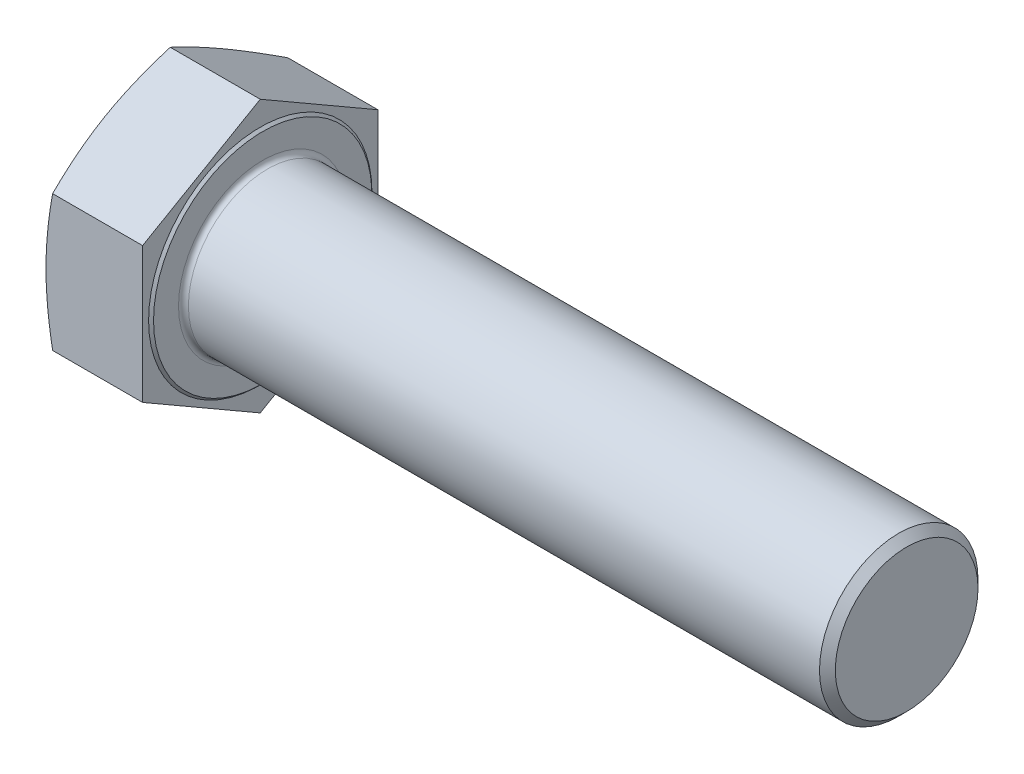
ISO-10303-21;
HEADER;
FILE_DESCRIPTION(('STEP AP214'),'2;1');
FILE_NAME('part.step','',(''),(''),'','','');
FILE_SCHEMA(('AUTOMOTIVE_DESIGN { 1 0 10303 214 1 1 1 1 }'));
ENDSEC;
DATA;
#1=APPLICATION_CONTEXT('core data for automotive mechanical design processes');
#2=APPLICATION_PROTOCOL_DEFINITION('international standard','automotive_design',2000,#1);
#3=PRODUCT_CONTEXT('',#1,'mechanical');
#4=PRODUCT('Part','Part','',(#3));
#5=PRODUCT_RELATED_PRODUCT_CATEGORY('part','',(#4));
#6=PRODUCT_DEFINITION_FORMATION('','',#4);
#7=PRODUCT_DEFINITION_CONTEXT('part definition',#1,'design');
#8=PRODUCT_DEFINITION('design','',#6,#7);
#9=PRODUCT_DEFINITION_SHAPE('','',#8);
#10=(LENGTH_UNIT() NAMED_UNIT(*) SI_UNIT(.MILLI.,.METRE.));
#11=(NAMED_UNIT(*) PLANE_ANGLE_UNIT() SI_UNIT($,.RADIAN.));
#12=(NAMED_UNIT(*) SI_UNIT($,.STERADIAN.) SOLID_ANGLE_UNIT());
#13=UNCERTAINTY_MEASURE_WITH_UNIT(LENGTH_MEASURE(1.E-05),#10,'distance_accuracy_value','');
#14=(GEOMETRIC_REPRESENTATION_CONTEXT(3) GLOBAL_UNCERTAINTY_ASSIGNED_CONTEXT((#13)) GLOBAL_UNIT_ASSIGNED_CONTEXT((#10,
#11,#12)) REPRESENTATION_CONTEXT('',''));
#15=CARTESIAN_POINT('',(0.,0.,0.));
#16=DIRECTION('',(0.,0.,1.));
#17=DIRECTION('',(1.,0.,0.));
#18=AXIS2_PLACEMENT_3D('',#15,#16,#17);
#19=CARTESIAN_POINT('',(40.,0.,95.));
#20=DIRECTION('',(-1.,0.,0.));
#21=DIRECTION('',(0.,0.,1.));
#22=AXIS2_PLACEMENT_3D('',#19,#20,#21);
#23=PLANE('',#22);
#24=CARTESIAN_POINT('',(40.,0.,0.));
#25=DIRECTION('',(-1.,0.,0.));
#26=DIRECTION('',(0.,0.,1.));
#27=AXIS2_PLACEMENT_3D('',#24,#25,#26);
#28=CIRCLE('',#27,34.);
#29=CARTESIAN_POINT('',(40.,0.,34.));
#30=VERTEX_POINT('',#29);
#31=EDGE_CURVE('E11',#30,#30,#28,.T.);
#32=ORIENTED_EDGE('',*,*,#31,.T.);
#33=EDGE_LOOP('',(#32));
#34=FACE_BOUND('',#33,.T.);
#35=CARTESIAN_POINT('',(40.,0.,0.));
#36=DIRECTION('',(-1.,0.,0.));
#37=DIRECTION('',(0.,0.,1.));
#38=AXIS2_PLACEMENT_3D('',#35,#36,#37);
#39=CIRCLE('',#38,44.08);
#40=CARTESIAN_POINT('',(40.,0.,44.08));
#41=VERTEX_POINT('',#40);
#42=EDGE_CURVE('E259',#41,#41,#39,.T.);
#43=ORIENTED_EDGE('',*,*,#42,.F.);
#44=EDGE_LOOP('',(#43));
#45=FACE_BOUND('',#44,.T.);
#46=ADVANCED_FACE('F32',(#34,#45),#23,.F.);
#47=CARTESIAN_POINT('',(40.,-27.4241377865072,47.5));
#48=DIRECTION('',(0.,0.866025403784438,-0.5));
#49=DIRECTION('',(0.,0.5,0.866025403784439));
#50=AXIS2_PLACEMENT_3D('',#47,#48,#49);
#51=PLANE('',#50);
#52=CARTESIAN_POINT('',(2.6745956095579,-54.8483910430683,-0.000200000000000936));
#53=CARTESIAN_POINT('',(2.46789812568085,-54.2804811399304,0.98344880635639));
#54=CARTESIAN_POINT('',(2.27050260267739,-53.7117047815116,1.96859835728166));
#55=CARTESIAN_POINT('',(1.89634764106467,-52.5724052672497,3.94192300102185));
#56=CARTESIAN_POINT('',(1.71959016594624,-52.0018819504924,4.93009837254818));
#57=CARTESIAN_POINT('',(1.38865728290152,-50.8587464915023,6.91006706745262));
#58=CARTESIAN_POINT('',(1.2344992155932,-50.2861330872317,7.90186257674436));
#59=CARTESIAN_POINT('',(0.950972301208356,-49.1393836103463,9.88809093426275));
#60=CARTESIAN_POINT('',(0.821602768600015,-48.5652475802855,10.882523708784));
#61=CARTESIAN_POINT('',(0.590651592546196,-47.4210419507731,12.8643459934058));
#62=CARTESIAN_POINT('',(0.48881943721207,-46.8509850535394,13.8517135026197));
#63=CARTESIAN_POINT('',(0.312966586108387,-45.7097910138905,15.8283195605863));
#64=CARTESIAN_POINT('',(0.238946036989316,-45.1386538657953,16.8175581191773));
#65=CARTESIAN_POINT('',(0.1200039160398,-43.9958275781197,18.7969913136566));
#66=CARTESIAN_POINT('',(0.0750717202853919,-43.4241387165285,19.7871854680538));
#67=CARTESIAN_POINT('',(0.0150698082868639,-42.2803687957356,21.7682530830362));
#68=CARTESIAN_POINT('',(0.,-41.7082877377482,22.7591265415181));
#69=CARTESIAN_POINT('',(0.,-40.5641256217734,24.7408734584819));
#70=CARTESIAN_POINT('',(0.0150698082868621,-39.992044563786,25.7317469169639));
#71=CARTESIAN_POINT('',(0.075071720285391,-38.8482746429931,27.7128145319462));
#72=CARTESIAN_POINT('',(0.120003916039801,-38.2765857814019,28.7030086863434));
#73=CARTESIAN_POINT('',(0.238946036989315,-37.1337594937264,30.6824418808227));
#74=CARTESIAN_POINT('',(0.312966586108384,-36.5626223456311,31.6716804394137));
#75=CARTESIAN_POINT('',(0.488819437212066,-35.4214283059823,33.6482864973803));
#76=CARTESIAN_POINT('',(0.590651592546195,-34.8513714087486,34.6356540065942));
#77=CARTESIAN_POINT('',(0.821602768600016,-33.7071657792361,36.617476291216));
#78=CARTESIAN_POINT('',(0.950972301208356,-33.1330297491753,37.6119090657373));
#79=CARTESIAN_POINT('',(1.2344992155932,-31.98628027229,39.5981374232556));
#80=CARTESIAN_POINT('',(1.38865728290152,-31.4136668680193,40.5899329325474));
#81=CARTESIAN_POINT('',(1.71959016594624,-30.2705314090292,42.5699016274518));
#82=CARTESIAN_POINT('',(1.89634764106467,-29.7000080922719,43.5580769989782));
#83=CARTESIAN_POINT('',(2.27050260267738,-28.56070857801,45.5314016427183));
#84=CARTESIAN_POINT('',(2.46789812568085,-27.9919322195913,46.5165511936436));
#85=CARTESIAN_POINT('',(2.67459560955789,-27.4240223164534,47.5002));
#86=B_SPLINE_CURVE_WITH_KNOTS('',3,(#52,#53,#54,#55,#56,#57,#58,#59,#60,#61,#62,#63,#64,#65,#66,
#67,#68,#69,#70,#71,#72,#73,#74,#75,#76,#77,#78,#79,#80,#81,#82,#83,#84,#85),.UNSPECIFIED.,.F.,
.F.,(4,2,2,2,2,2,2,2,2,2,2,2,2,2,2,2,4),(0.,3.46344234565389,6.92721393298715,10.3936295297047,
13.8599492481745,17.2935848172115,20.7272384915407,24.1596373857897,27.5920257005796,
31.0244140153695,34.4568129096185,37.8904665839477,41.3241021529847,44.7904218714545,
48.2568374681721,51.7206090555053,55.1840514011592),.UNSPECIFIED.);
#87=CARTESIAN_POINT('',(2.67455358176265,-54.8482755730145,1.07552855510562E-13));
#88=VERTEX_POINT('',#87);
#89=CARTESIAN_POINT('',(0.,-41.1362066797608,23.75));
#90=VERTEX_POINT('',#89);
#91=EDGE_CURVE('E278',#88,#90,#86,.T.);
#92=ORIENTED_EDGE('',*,*,#91,.F.);
#93=DIRECTION('',(-1.,0.,0.));
#94=VECTOR('',#93,1.);
#95=CARTESIAN_POINT('',(40.,-54.8482755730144,0.));
#96=LINE('',#95,#94);
#97=CARTESIAN_POINT('',(39.,-54.8482755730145,0.));
#98=VERTEX_POINT('',#97);
#99=EDGE_CURVE('E144',#98,#88,#96,.T.);
#100=ORIENTED_EDGE('',*,*,#99,.F.);
#101=DIRECTION('',(0.,-0.5,-0.866025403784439));
#102=VECTOR('',#101,1.);
#103=CARTESIAN_POINT('',(39.,-27.4241377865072,47.5));
#104=LINE('',#103,#102);
#105=CARTESIAN_POINT('',(39.,-27.4241377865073,47.5));
#106=VERTEX_POINT('',#105);
#107=EDGE_CURVE('E135',#106,#98,#104,.T.);
#108=ORIENTED_EDGE('',*,*,#107,.F.);
#109=DIRECTION('',(-1.,0.,0.));
#110=VECTOR('',#109,1.);
#111=CARTESIAN_POINT('',(40.,-27.4241377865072,47.5));
#112=LINE('',#111,#110);
#113=CARTESIAN_POINT('',(2.67455358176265,-27.4241377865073,47.5));
#114=VERTEX_POINT('',#113);
#115=EDGE_CURVE('E130',#106,#114,#112,.T.);
#116=ORIENTED_EDGE('',*,*,#115,.T.);
#117=EDGE_CURVE('E124',#90,#114,#86,.T.);
#118=ORIENTED_EDGE('',*,*,#117,.F.);
#119=EDGE_LOOP('',(#92,#100,#108,#116,#118));
#120=FACE_BOUND('',#119,.T.);
#121=ADVANCED_FACE('F34',(#120),#51,.F.);
#122=CARTESIAN_POINT('',(40.,-54.8482755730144,0.));
#123=DIRECTION('',(0.,0.866025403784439,0.5));
#124=DIRECTION('',(0.,-0.5,0.866025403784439));
#125=AXIS2_PLACEMENT_3D('',#122,#123,#124);
#126=PLANE('',#125);
#127=CARTESIAN_POINT('',(2.6745956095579,-27.4240223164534,-47.5002));
#128=CARTESIAN_POINT('',(2.46789812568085,-27.9919322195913,-46.5165511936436));
#129=CARTESIAN_POINT('',(2.27050260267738,-28.5607085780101,-45.5314016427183));
#130=CARTESIAN_POINT('',(1.89634764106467,-29.700008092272,-43.5580769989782));
#131=CARTESIAN_POINT('',(1.71959016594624,-30.2705314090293,-42.5699016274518));
#132=CARTESIAN_POINT('',(1.38865728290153,-31.4136668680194,-40.5899329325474));
#133=CARTESIAN_POINT('',(1.2344992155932,-31.98628027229,-39.5981374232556));
#134=CARTESIAN_POINT('',(0.950972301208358,-33.1330297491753,-37.6119090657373));
#135=CARTESIAN_POINT('',(0.82160276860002,-33.7071657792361,-36.617476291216));
#136=CARTESIAN_POINT('',(0.590651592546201,-34.8513714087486,-34.6356540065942));
#137=CARTESIAN_POINT('',(0.488819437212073,-35.4214283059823,-33.6482864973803));
#138=CARTESIAN_POINT('',(0.312966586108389,-36.5626223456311,-31.6716804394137));
#139=CARTESIAN_POINT('',(0.23894603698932,-37.1337594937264,-30.6824418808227));
#140=CARTESIAN_POINT('',(0.120003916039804,-38.2765857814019,-28.7030086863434));
#141=CARTESIAN_POINT('',(0.0750717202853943,-38.8482746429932,-27.7128145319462));
#142=CARTESIAN_POINT('',(0.0150698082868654,-39.9920445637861,-25.7317469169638));
#143=CARTESIAN_POINT('',(0.,-40.5641256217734,-24.7408734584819));
#144=CARTESIAN_POINT('',(0.,-41.7082877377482,-22.7591265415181));
#145=CARTESIAN_POINT('',(0.0150698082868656,-42.2803687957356,-21.7682530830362));
#146=CARTESIAN_POINT('',(0.0750717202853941,-43.4241387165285,-19.7871854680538));
#147=CARTESIAN_POINT('',(0.120003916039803,-43.9958275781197,-18.7969913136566));
#148=CARTESIAN_POINT('',(0.238946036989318,-45.1386538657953,-16.8175581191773));
#149=CARTESIAN_POINT('',(0.312966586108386,-45.7097910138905,-15.8283195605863));
#150=CARTESIAN_POINT('',(0.488819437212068,-46.8509850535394,-13.8517135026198));
#151=CARTESIAN_POINT('',(0.590651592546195,-47.4210419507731,-12.8643459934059));
#152=CARTESIAN_POINT('',(0.821602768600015,-48.5652475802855,-10.882523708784));
#153=CARTESIAN_POINT('',(0.950972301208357,-49.1393836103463,-9.88809093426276));
#154=CARTESIAN_POINT('',(1.2344992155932,-50.2861330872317,-7.90186257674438));
#155=CARTESIAN_POINT('',(1.38865728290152,-50.8587464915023,-6.91006706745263));
#156=CARTESIAN_POINT('',(1.71959016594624,-52.0018819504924,-4.93009837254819));
#157=CARTESIAN_POINT('',(1.89634764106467,-52.5724052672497,-3.94192300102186));
#158=CARTESIAN_POINT('',(2.27050260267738,-53.7117047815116,-1.96859835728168));
#159=CARTESIAN_POINT('',(2.46789812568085,-54.2804811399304,-0.983448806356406));
#160=CARTESIAN_POINT('',(2.67459560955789,-54.8483910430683,0.000199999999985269));
#161=B_SPLINE_CURVE_WITH_KNOTS('',3,(#127,#128,#129,#130,#131,#132,#133,#134,#135,#136,#137,
#138,#139,#140,#141,#142,#143,#144,#145,#146,#147,#148,#149,#150,#151,#152,#153,#154,#155,#156,
#157,#158,#159,#160),.UNSPECIFIED.,.F.,.F.,(4,2,2,2,2,2,2,2,2,2,2,2,2,2,2,2,4),(0.,
3.46344234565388,6.92721393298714,10.3936295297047,13.8599492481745,17.2935848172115,
20.7272384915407,24.1596373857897,27.5920257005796,31.0244140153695,34.4568129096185,
37.8904665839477,41.3241021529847,44.7904218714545,48.256837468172,51.7206090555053,
55.1840514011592),.UNSPECIFIED.);
#162=CARTESIAN_POINT('',(2.67455358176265,-27.4241377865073,-47.5));
#163=VERTEX_POINT('',#162);
#164=CARTESIAN_POINT('',(0.,-41.1362066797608,-23.75));
#165=VERTEX_POINT('',#164);
#166=EDGE_CURVE('E230',#163,#165,#161,.T.);
#167=ORIENTED_EDGE('',*,*,#166,.F.);
#168=DIRECTION('',(-1.,0.,0.));
#169=VECTOR('',#168,1.);
#170=CARTESIAN_POINT('',(40.,-27.4241377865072,-47.5));
#171=LINE('',#170,#169);
#172=CARTESIAN_POINT('',(39.,-27.4241377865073,-47.5));
#173=VERTEX_POINT('',#172);
#174=EDGE_CURVE('E141',#173,#163,#171,.T.);
#175=ORIENTED_EDGE('',*,*,#174,.F.);
#176=DIRECTION('',(0.,0.5,-0.866025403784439));
#177=VECTOR('',#176,1.);
#178=CARTESIAN_POINT('',(39.,-54.8482755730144,0.));
#179=LINE('',#178,#177);
#180=EDGE_CURVE('E268',#98,#173,#179,.T.);
#181=ORIENTED_EDGE('',*,*,#180,.F.);
#182=ORIENTED_EDGE('',*,*,#99,.T.);
#183=EDGE_CURVE('E226',#165,#88,#161,.T.);
#184=ORIENTED_EDGE('',*,*,#183,.F.);
#185=EDGE_LOOP('',(#167,#175,#181,#182,#184));
#186=FACE_BOUND('',#185,.T.);
#187=ADVANCED_FACE('F180',(#186),#126,.F.);
#188=CARTESIAN_POINT('',(40.,-27.4241377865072,-47.5));
#189=DIRECTION('',(0.,0.,1.));
#190=DIRECTION('',(0.,-1.,0.));
#191=AXIS2_PLACEMENT_3D('',#188,#189,#190);
#192=PLANE('',#191);
#193=CARTESIAN_POINT('',(14.2917536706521,-72.6094738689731,-47.5));
#194=CARTESIAN_POINT('',(13.9644810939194,-71.534954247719,-47.5));
#195=CARTESIAN_POINT('',(13.6391829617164,-70.4598313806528,-47.5));
#196=CARTESIAN_POINT('',(12.9929882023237,-68.3082572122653,-47.5));
#197=CARTESIAN_POINT('',(12.6720916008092,-67.2318059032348,-47.5));
#198=CARTESIAN_POINT('',(12.0351315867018,-65.0773816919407,-47.5));
#199=CARTESIAN_POINT('',(11.7190685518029,-63.9994086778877,-47.5));
#200=CARTESIAN_POINT('',(11.0923375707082,-61.8418982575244,-47.5));
#201=CARTESIAN_POINT('',(10.7816696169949,-60.7623608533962,-47.5));
#202=CARTESIAN_POINT('',(9.85747603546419,-57.5171579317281,-47.5));
#203=CARTESIAN_POINT('',(9.25295184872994,-55.3489151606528,-47.5));
#204=CARTESIAN_POINT('',(8.07364144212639,-51.004372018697,-47.5));
#205=CARTESIAN_POINT('',(7.49885468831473,-48.8280717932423,-47.5));
#206=CARTESIAN_POINT('',(6.39326653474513,-44.4928457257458,-47.5));
#207=CARTESIAN_POINT('',(5.86201019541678,-42.3340364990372,-47.5));
#208=CARTESIAN_POINT('',(4.84472633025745,-38.0056776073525,-47.5));
#209=CARTESIAN_POINT('',(4.3586995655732,-35.8361277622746,-47.5));
#210=CARTESIAN_POINT('',(3.44320866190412,-31.4857942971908,-47.5));
#211=CARTESIAN_POINT('',(3.01372522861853,-29.3050147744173,-47.5));
#212=CARTESIAN_POINT('',(2.22439409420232,-24.9308159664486,-47.5));
#213=CARTESIAN_POINT('',(1.86454405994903,-22.7373971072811,-47.5));
#214=CARTESIAN_POINT('',(1.26474387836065,-18.5848116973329,-47.5));
#215=CARTESIAN_POINT('',(1.01587422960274,-16.6269537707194,-47.5));
#216=CARTESIAN_POINT('',(0.699882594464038,-13.6840760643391,-47.5));
#217=CARTESIAN_POINT('',(0.604103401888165,-12.7020901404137,-47.5));
#218=CARTESIAN_POINT('',(0.43272380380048,-10.7363426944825,-47.5));
#219=CARTESIAN_POINT('',(0.357123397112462,-9.75258117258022,-47.5));
#220=CARTESIAN_POINT('',(0.227082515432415,-7.78434865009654,-47.5));
#221=CARTESIAN_POINT('',(0.172627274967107,-6.79987862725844,-47.5));
#222=CARTESIAN_POINT('',(0.0855050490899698,-4.82997097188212,-47.5));
#223=CARTESIAN_POINT('',(0.0528380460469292,-3.84453334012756,-47.5));
#224=CARTESIAN_POINT('',(0.00973154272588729,-1.87317368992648,-47.5));
#225=CARTESIAN_POINT('',(-0.000708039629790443,-0.887251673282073,-47.5));
#226=CARTESIAN_POINT('',(0.000782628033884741,1.08457560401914,-47.5));
#227=CARTESIAN_POINT('',(0.012712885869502,2.07048086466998,-47.5));
#228=CARTESIAN_POINT('',(0.0588972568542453,4.04676622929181,-47.5));
#229=CARTESIAN_POINT('',(0.0932642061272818,5.03714368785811,-47.5));
#230=CARTESIAN_POINT('',(0.183965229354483,7.01688740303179,-47.5));
#231=CARTESIAN_POINT('',(0.24029931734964,8.00625365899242,-47.5));
#232=CARTESIAN_POINT('',(0.374203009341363,9.9835602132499,-47.5));
#233=CARTESIAN_POINT('',(0.451772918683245,10.9715004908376,-47.5));
#234=CARTESIAN_POINT('',(0.627184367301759,12.9455599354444,-47.5));
#235=CARTESIAN_POINT('',(0.725025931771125,13.9316791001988,-47.5));
#236=CARTESIAN_POINT('',(1.0474838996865,16.8885587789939,-47.5));
#237=CARTESIAN_POINT('',(1.30092205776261,18.8562442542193,-47.5));
#238=CARTESIAN_POINT('',(1.73104906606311,21.8002454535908,-47.5));
#239=CARTESIAN_POINT('',(1.88275591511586,22.780340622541,-47.5));
#240=CARTESIAN_POINT('',(2.20151918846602,24.7380474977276,-47.5));
#241=CARTESIAN_POINT('',(2.36857571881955,25.7156591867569,-47.5));
#242=CARTESIAN_POINT('',(2.90923921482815,28.7479678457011,-47.5));
#243=CARTESIAN_POINT('',(3.30698744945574,30.7983780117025,-47.5));
#244=CARTESIAN_POINT('',(4.15366697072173,34.8886319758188,-47.5));
#245=CARTESIAN_POINT('',(4.60260211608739,36.9284749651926,-47.5));
#246=CARTESIAN_POINT('',(5.54223962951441,40.9990953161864,-47.5));
#247=CARTESIAN_POINT('',(6.03295412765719,43.0298698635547,-47.5));
#248=CARTESIAN_POINT('',(7.04816495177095,47.0828615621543,-47.5));
#249=CARTESIAN_POINT('',(7.57266046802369,49.1050789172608,-47.5));
#250=CARTESIAN_POINT('',(8.64981077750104,53.1447558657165,-47.5));
#251=CARTESIAN_POINT('',(9.20250086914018,55.1622060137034,-47.5));
#252=CARTESIAN_POINT('',(10.3303638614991,59.1908031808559,-47.5));
#253=CARTESIAN_POINT('',(10.9055368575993,61.2019501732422,-47.5));
#254=CARTESIAN_POINT('',(12.074250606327,65.2185225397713,-47.5));
#255=CARTESIAN_POINT('',(12.6677882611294,67.2239488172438,-47.5));
#256=CARTESIAN_POINT('',(13.870132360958,71.2302065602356,-47.5));
#257=CARTESIAN_POINT('',(14.4789387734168,73.2310380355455,-47.5));
#258=CARTESIAN_POINT('',(15.7024853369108,77.2067106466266,-47.5));
#259=CARTESIAN_POINT('',(16.3170857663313,79.1815948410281,-47.5));
#260=CARTESIAN_POINT('',(17.5567558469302,83.1280715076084,-47.5));
#261=CARTESIAN_POINT('',(18.1818254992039,85.0996639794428,-47.5));
#262=CARTESIAN_POINT('',(19.4408617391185,89.0401033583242,-47.5));
#263=CARTESIAN_POINT('',(20.0748287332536,91.0089501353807,-47.5));
#264=CARTESIAN_POINT('',(21.3503275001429,94.9441922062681,-47.5));
#265=CARTESIAN_POINT('',(21.9918592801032,96.9105874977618,-47.5));
#266=CARTESIAN_POINT('',(23.2789683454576,100.833786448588,-47.5));
#267=CARTESIAN_POINT('',(23.9245210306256,102.790598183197,-47.5));
#268=CARTESIAN_POINT('',(25.2211970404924,106.702375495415,-47.5));
#269=CARTESIAN_POINT('',(25.8723203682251,108.657341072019,-47.5));
#270=CARTESIAN_POINT('',(27.1793499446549,112.565494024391,-47.5));
#271=CARTESIAN_POINT('',(27.8352557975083,114.518681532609,-47.5));
#272=CARTESIAN_POINT('',(29.1513116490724,118.423621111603,-47.5));
#273=CARTESIAN_POINT('',(29.8114616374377,120.375373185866,-47.5));
#274=CARTESIAN_POINT('',(30.4734395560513,122.32650357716,-47.5));
#275=B_SPLINE_CURVE_WITH_KNOTS('',3,(#193,#194,#195,#196,#197,#198,#199,#200,#201,#202,#203,
#204,#205,#206,#207,#208,#209,#210,#211,#212,#213,#214,#215,#216,#217,#218,#219,#220,#221,#222,
#223,#224,#225,#226,#227,#228,#229,#230,#231,#232,#233,#234,#235,#236,#237,#238,#239,#240,#241,
#242,#243,#244,#245,#246,#247,#248,#249,#250,#251,#252,#253,#254,#255,#256,#257,#258,#259,#260,
#261,#262,#263,#264,#265,#266,#267,#268,#269,#270,#271,#272,#273,#274),.UNSPECIFIED.,.F.,.F.,(4,
2,2,2,2,2,2,2,2,2,2,2,2,2,2,2,2,2,2,2,2,2,2,2,2,2,2,2,2,2,2,2,2,2,2,2,2,2,2,2,4),(0.,
3.36976291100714,6.73954547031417,10.1095900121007,13.4796298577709,20.2322684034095,
26.9847856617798,33.654047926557,40.3234224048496,46.9905151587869,53.6573844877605,
59.5767707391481,62.5365332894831,65.4962956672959,68.4539875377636,71.4116770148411,
74.369355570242,77.3270351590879,80.2997049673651,83.2723766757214,86.2450911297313,
89.2178092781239,95.1680455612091,98.1432608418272,101.118496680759,107.383502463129,
113.648980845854,119.916284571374,126.183438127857,132.458640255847,138.73386900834,
145.00804493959,151.282207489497,157.487099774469,163.69199270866,169.897170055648,
176.102353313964,182.283982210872,188.465614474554,194.646740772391,200.827852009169),.UNSPECIFIED.);
#276=CARTESIAN_POINT('',(2.67455358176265,27.4241377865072,-47.5000000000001));
#277=VERTEX_POINT('',#276);
#278=CARTESIAN_POINT('',(0.,0.,-47.5));
#279=VERTEX_POINT('',#278);
#280=EDGE_CURVE('E304',#277,#279,#275,.F.);
#281=ORIENTED_EDGE('',*,*,#280,.F.);
#282=DIRECTION('',(-1.,0.,0.));
#283=VECTOR('',#282,1.);
#284=CARTESIAN_POINT('',(40.,27.4241377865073,-47.5));
#285=LINE('',#284,#283);
#286=CARTESIAN_POINT('',(39.,27.4241377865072,-47.5000000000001));
#287=VERTEX_POINT('',#286);
#288=EDGE_CURVE('E132',#287,#277,#285,.T.);
#289=ORIENTED_EDGE('',*,*,#288,.F.);
#290=DIRECTION('',(0.,1.,0.));
#291=VECTOR('',#290,1.);
#292=CARTESIAN_POINT('',(39.,-27.4241377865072,-47.5));
#293=LINE('',#292,#291);
#294=EDGE_CURVE('E261',#173,#287,#293,.T.);
#295=ORIENTED_EDGE('',*,*,#294,.F.);
#296=ORIENTED_EDGE('',*,*,#174,.T.);
#297=EDGE_CURVE('E231',#279,#163,#275,.F.);
#298=ORIENTED_EDGE('',*,*,#297,.F.);
#299=EDGE_LOOP('',(#281,#289,#295,#296,#298));
#300=FACE_BOUND('',#299,.T.);
#301=ADVANCED_FACE('F239',(#300),#192,.F.);
#302=CARTESIAN_POINT('',(40.,27.4241377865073,-47.5));
#303=DIRECTION('',(0.,-0.866025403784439,0.5));
#304=DIRECTION('',(0.,-0.5,-0.866025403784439));
#305=AXIS2_PLACEMENT_3D('',#302,#303,#304);
#306=PLANE('',#305);
#307=CARTESIAN_POINT('',(2.67459560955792,54.8483910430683,0.000199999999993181));
#308=CARTESIAN_POINT('',(2.46789812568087,54.2804811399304,-0.983448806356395));
#309=CARTESIAN_POINT('',(2.2705026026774,53.7117047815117,-1.96859835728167));
#310=CARTESIAN_POINT('',(1.89634764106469,52.5724052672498,-3.94192300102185));
#311=CARTESIAN_POINT('',(1.71959016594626,52.0018819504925,-4.93009837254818));
#312=CARTESIAN_POINT('',(1.38865728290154,50.8587464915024,-6.91006706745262));
#313=CARTESIAN_POINT('',(1.23449921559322,50.2861330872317,-7.90186257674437));
#314=CARTESIAN_POINT('',(0.950972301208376,49.1393836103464,-9.88809093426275));
#315=CARTESIAN_POINT('',(0.821602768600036,48.5652475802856,-10.882523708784));
#316=CARTESIAN_POINT('',(0.590651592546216,47.4210419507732,-12.8643459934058));
#317=CARTESIAN_POINT('',(0.488819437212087,46.8509850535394,-13.8517135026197));
#318=CARTESIAN_POINT('',(0.312966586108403,45.7097910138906,-15.8283195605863));
#319=CARTESIAN_POINT('',(0.238946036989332,45.1386538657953,-16.8175581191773));
#320=CARTESIAN_POINT('',(0.120003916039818,43.9958275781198,-18.7969913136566));
#321=CARTESIAN_POINT('',(0.0750717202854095,43.4241387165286,-19.7871854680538));
#322=CARTESIAN_POINT('',(0.0150698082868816,42.2803687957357,-21.7682530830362));
#323=CARTESIAN_POINT('',(0.,41.7082877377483,-22.7591265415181));
#324=CARTESIAN_POINT('',(0.,40.5641256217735,-24.7408734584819));
#325=CARTESIAN_POINT('',(0.0150698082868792,39.9920445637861,-25.7317469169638));
#326=CARTESIAN_POINT('',(0.0750717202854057,38.8482746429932,-27.7128145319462));
#327=CARTESIAN_POINT('',(0.120003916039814,38.276585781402,-28.7030086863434));
#328=CARTESIAN_POINT('',(0.238946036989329,37.1337594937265,-30.6824418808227));
#329=CARTESIAN_POINT('',(0.3129665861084,36.5626223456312,-31.6716804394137));
#330=CARTESIAN_POINT('',(0.488819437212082,35.4214283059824,-33.6482864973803));
#331=CARTESIAN_POINT('',(0.590651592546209,34.8513714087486,-34.6356540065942));
#332=CARTESIAN_POINT('',(0.821602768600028,33.7071657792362,-36.617476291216));
#333=CARTESIAN_POINT('',(0.950972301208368,33.1330297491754,-37.6119090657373));
#334=CARTESIAN_POINT('',(1.23449921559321,31.9862802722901,-39.5981374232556));
#335=CARTESIAN_POINT('',(1.38865728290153,31.4136668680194,-40.5899329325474));
#336=CARTESIAN_POINT('',(1.71959016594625,30.2705314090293,-42.5699016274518));
#337=CARTESIAN_POINT('',(1.89634764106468,29.700008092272,-43.5580769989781));
#338=CARTESIAN_POINT('',(2.27050260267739,28.5607085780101,-45.5314016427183));
#339=CARTESIAN_POINT('',(2.46789812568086,27.9919322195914,-46.5165511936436));
#340=CARTESIAN_POINT('',(2.6745956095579,27.4240223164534,-47.5002));
#341=B_SPLINE_CURVE_WITH_KNOTS('',3,(#307,#308,#309,#310,#311,#312,#313,#314,#315,#316,#317,
#318,#319,#320,#321,#322,#323,#324,#325,#326,#327,#328,#329,#330,#331,#332,#333,#334,#335,#336,
#337,#338,#339,#340),.UNSPECIFIED.,.F.,.F.,(4,2,2,2,2,2,2,2,2,2,2,2,2,2,2,2,4),(0.,
3.46344234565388,6.92721393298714,10.3936295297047,13.8599492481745,17.2935848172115,
20.7272384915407,24.1596373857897,27.5920257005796,31.0244140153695,34.4568129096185,
37.8904665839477,41.3241021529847,44.7904218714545,48.256837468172,51.7206090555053,
55.1840514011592),.UNSPECIFIED.);
#342=CARTESIAN_POINT('',(2.67455358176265,54.8482755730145,0.));
#343=VERTEX_POINT('',#342);
#344=CARTESIAN_POINT('',(0.,41.1362066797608,-23.75));
#345=VERTEX_POINT('',#344);
#346=EDGE_CURVE('E221',#343,#345,#341,.T.);
#347=ORIENTED_EDGE('',*,*,#346,.F.);
#348=DIRECTION('',(-1.,0.,0.));
#349=VECTOR('',#348,1.);
#350=CARTESIAN_POINT('',(40.,54.8482755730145,0.));
#351=LINE('',#350,#349);
#352=CARTESIAN_POINT('',(39.,54.8482755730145,0.));
#353=VERTEX_POINT('',#352);
#354=EDGE_CURVE('E129',#353,#343,#351,.T.);
#355=ORIENTED_EDGE('',*,*,#354,.F.);
#356=DIRECTION('',(0.,0.5,0.866025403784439));
#357=VECTOR('',#356,1.);
#358=CARTESIAN_POINT('',(39.,27.4241377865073,-47.5));
#359=LINE('',#358,#357);
#360=EDGE_CURVE('E258',#287,#353,#359,.T.);
#361=ORIENTED_EDGE('',*,*,#360,.F.);
#362=ORIENTED_EDGE('',*,*,#288,.T.);
#363=EDGE_CURVE('E255',#345,#277,#341,.T.);
#364=ORIENTED_EDGE('',*,*,#363,.F.);
#365=EDGE_LOOP('',(#347,#355,#361,#362,#364));
#366=FACE_BOUND('',#365,.T.);
#367=ADVANCED_FACE('F243',(#366),#306,.F.);
#368=CARTESIAN_POINT('',(40.,54.8482755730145,0.));
#369=DIRECTION('',(0.,-0.866025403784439,-0.5));
#370=DIRECTION('',(0.,0.5,-0.866025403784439));
#371=AXIS2_PLACEMENT_3D('',#368,#369,#370);
#372=PLANE('',#371);
#373=CARTESIAN_POINT('',(2.67459560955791,27.4240223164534,47.5002));
#374=CARTESIAN_POINT('',(2.46789812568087,27.9919322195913,46.5165511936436));
#375=CARTESIAN_POINT('',(2.2705026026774,28.5607085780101,45.5314016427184));
#376=CARTESIAN_POINT('',(1.89634764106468,29.700008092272,43.5580769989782));
#377=CARTESIAN_POINT('',(1.71959016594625,30.2705314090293,42.5699016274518));
#378=CARTESIAN_POINT('',(1.38865728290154,31.4136668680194,40.5899329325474));
#379=CARTESIAN_POINT('',(1.23449921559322,31.98628027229,39.5981374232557));
#380=CARTESIAN_POINT('',(0.950972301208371,33.1330297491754,37.6119090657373));
#381=CARTESIAN_POINT('',(0.821602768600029,33.7071657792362,36.617476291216));
#382=CARTESIAN_POINT('',(0.59065159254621,34.8513714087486,34.6356540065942));
#383=CARTESIAN_POINT('',(0.488819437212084,35.4214283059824,33.6482864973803));
#384=CARTESIAN_POINT('',(0.312966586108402,36.5626223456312,31.6716804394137));
#385=CARTESIAN_POINT('',(0.238946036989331,37.1337594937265,30.6824418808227));
#386=CARTESIAN_POINT('',(0.120003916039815,38.276585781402,28.7030086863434));
#387=CARTESIAN_POINT('',(0.0750717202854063,38.8482746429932,27.7128145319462));
#388=CARTESIAN_POINT('',(0.0150698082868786,39.9920445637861,25.7317469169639));
#389=CARTESIAN_POINT('',(0.,40.5641256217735,24.7408734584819));
#390=CARTESIAN_POINT('',(0.,41.7082877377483,22.7591265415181));
#391=CARTESIAN_POINT('',(0.0150698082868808,42.2803687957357,21.7682530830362));
#392=CARTESIAN_POINT('',(0.075071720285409,43.4241387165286,19.7871854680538));
#393=CARTESIAN_POINT('',(0.120003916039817,43.9958275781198,18.7969913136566));
#394=CARTESIAN_POINT('',(0.238946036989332,45.1386538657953,16.8175581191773));
#395=CARTESIAN_POINT('',(0.312966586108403,45.7097910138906,15.8283195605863));
#396=CARTESIAN_POINT('',(0.488819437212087,46.8509850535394,13.8517135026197));
#397=CARTESIAN_POINT('',(0.590651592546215,47.4210419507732,12.8643459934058));
#398=CARTESIAN_POINT('',(0.821602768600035,48.5652475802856,10.882523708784));
#399=CARTESIAN_POINT('',(0.950972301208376,49.1393836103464,9.88809093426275));
#400=CARTESIAN_POINT('',(1.23449921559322,50.2861330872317,7.90186257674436));
#401=CARTESIAN_POINT('',(1.38865728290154,50.8587464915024,6.91006706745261));
#402=CARTESIAN_POINT('',(1.71959016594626,52.0018819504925,4.93009837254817));
#403=CARTESIAN_POINT('',(1.89634764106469,52.5724052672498,3.94192300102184));
#404=CARTESIAN_POINT('',(2.2705026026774,53.7117047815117,1.96859835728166));
#405=CARTESIAN_POINT('',(2.46789812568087,54.2804811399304,0.983448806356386));
#406=CARTESIAN_POINT('',(2.67459560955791,54.8483910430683,-0.000200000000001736));
#407=B_SPLINE_CURVE_WITH_KNOTS('',3,(#373,#374,#375,#376,#377,#378,#379,#380,#381,#382,#383,
#384,#385,#386,#387,#388,#389,#390,#391,#392,#393,#394,#395,#396,#397,#398,#399,#400,#401,#402,
#403,#404,#405,#406),.UNSPECIFIED.,.F.,.F.,(4,2,2,2,2,2,2,2,2,2,2,2,2,2,2,2,4),(0.,
3.46344234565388,6.92721393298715,10.3936295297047,13.8599492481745,17.2935848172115,
20.7272384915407,24.1596373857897,27.5920257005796,31.0244140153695,34.4568129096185,
37.8904665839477,41.3241021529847,44.7904218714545,48.2568374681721,51.7206090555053,
55.1840514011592),.UNSPECIFIED.);
#408=CARTESIAN_POINT('',(2.67455358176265,27.4241377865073,47.5));
#409=VERTEX_POINT('',#408);
#410=CARTESIAN_POINT('',(0.,41.1362066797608,23.75));
#411=VERTEX_POINT('',#410);
#412=EDGE_CURVE('E109',#409,#411,#407,.T.);
#413=ORIENTED_EDGE('',*,*,#412,.F.);
#414=DIRECTION('',(-1.,0.,0.));
#415=VECTOR('',#414,1.);
#416=CARTESIAN_POINT('',(40.,27.4241377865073,47.5));
#417=LINE('',#416,#415);
#418=CARTESIAN_POINT('',(39.,27.4241377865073,47.5));
#419=VERTEX_POINT('',#418);
#420=EDGE_CURVE('E121',#419,#409,#417,.T.);
#421=ORIENTED_EDGE('',*,*,#420,.F.);
#422=DIRECTION('',(0.,-0.5,0.866025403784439));
#423=VECTOR('',#422,1.);
#424=CARTESIAN_POINT('',(39.,54.8482755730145,0.));
#425=LINE('',#424,#423);
#426=EDGE_CURVE('E56',#353,#419,#425,.T.);
#427=ORIENTED_EDGE('',*,*,#426,.F.);
#428=ORIENTED_EDGE('',*,*,#354,.T.);
#429=EDGE_CURVE('E123',#411,#343,#407,.T.);
#430=ORIENTED_EDGE('',*,*,#429,.F.);
#431=EDGE_LOOP('',(#413,#421,#427,#428,#430));
#432=FACE_BOUND('',#431,.T.);
#433=ADVANCED_FACE('F120',(#432),#372,.F.);
#434=CARTESIAN_POINT('',(40.,27.4241377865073,47.5));
#435=DIRECTION('',(0.,0.,-1.));
#436=DIRECTION('',(-1.,0.,0.));
#437=AXIS2_PLACEMENT_3D('',#434,#435,#436);
#438=PLANE('',#437);
#439=CARTESIAN_POINT('',(14.2917536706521,-72.609473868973,47.5));
#440=CARTESIAN_POINT('',(13.9644810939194,-71.5349542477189,47.5));
#441=CARTESIAN_POINT('',(13.6391829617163,-70.4598313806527,47.5));
#442=CARTESIAN_POINT('',(12.9929882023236,-68.3082572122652,47.5));
#443=CARTESIAN_POINT('',(12.6720916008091,-67.2318059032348,47.5));
#444=CARTESIAN_POINT('',(12.0351315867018,-65.0773816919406,47.5));
#445=CARTESIAN_POINT('',(11.7190685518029,-63.9994086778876,47.5));
#446=CARTESIAN_POINT('',(11.0923375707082,-61.8418982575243,47.5));
#447=CARTESIAN_POINT('',(10.7816696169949,-60.7623608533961,47.5));
#448=CARTESIAN_POINT('',(9.85747603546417,-57.5171579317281,47.5));
#449=CARTESIAN_POINT('',(9.25295184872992,-55.3489151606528,47.5));
#450=CARTESIAN_POINT('',(8.07364144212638,-51.004372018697,47.5));
#451=CARTESIAN_POINT('',(7.49885468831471,-48.8280717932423,47.5));
#452=CARTESIAN_POINT('',(6.39326653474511,-44.4928457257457,47.5));
#453=CARTESIAN_POINT('',(5.86201019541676,-42.3340364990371,47.5));
#454=CARTESIAN_POINT('',(4.84472633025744,-38.0056776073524,47.5));
#455=CARTESIAN_POINT('',(4.35869956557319,-35.8361277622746,47.5));
#456=CARTESIAN_POINT('',(3.44320866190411,-31.4857942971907,47.5));
#457=CARTESIAN_POINT('',(3.01372522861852,-29.3050147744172,47.5));
#458=CARTESIAN_POINT('',(2.22439409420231,-24.9308159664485,47.5));
#459=CARTESIAN_POINT('',(1.86454405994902,-22.737397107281,47.5));
#460=CARTESIAN_POINT('',(1.26474387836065,-18.5848116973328,47.5));
#461=CARTESIAN_POINT('',(1.01587422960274,-16.6269537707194,47.5));
#462=CARTESIAN_POINT('',(0.699882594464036,-13.6840760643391,47.5));
#463=CARTESIAN_POINT('',(0.604103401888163,-12.7020901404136,47.5));
#464=CARTESIAN_POINT('',(0.432723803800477,-10.7363426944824,47.5));
#465=CARTESIAN_POINT('',(0.357123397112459,-9.75258117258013,47.5));
#466=CARTESIAN_POINT('',(0.227082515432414,-7.78434865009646,47.5));
#467=CARTESIAN_POINT('',(0.172627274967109,-6.79987862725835,47.5));
#468=CARTESIAN_POINT('',(0.0855050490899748,-4.82997097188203,47.5));
#469=CARTESIAN_POINT('',(0.052838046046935,-3.84453334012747,47.5));
#470=CARTESIAN_POINT('',(0.00973154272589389,-1.8731736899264,47.5));
#471=CARTESIAN_POINT('',(-0.000708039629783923,-0.887251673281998,47.5));
#472=CARTESIAN_POINT('',(0.000782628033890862,1.08457560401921,47.5));
#473=CARTESIAN_POINT('',(0.012712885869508,2.07048086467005,47.5));
#474=CARTESIAN_POINT('',(0.0588972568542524,4.04676622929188,47.5));
#475=CARTESIAN_POINT('',(0.0932642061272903,5.03714368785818,47.5));
#476=CARTESIAN_POINT('',(0.183965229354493,7.01688740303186,47.5));
#477=CARTESIAN_POINT('',(0.240299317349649,8.00625365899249,47.5));
#478=CARTESIAN_POINT('',(0.374203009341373,9.98356021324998,47.5));
#479=CARTESIAN_POINT('',(0.451772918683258,10.9715004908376,47.5));
#480=CARTESIAN_POINT('',(0.627184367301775,12.9455599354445,47.5));
#481=CARTESIAN_POINT('',(0.725025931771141,13.9316791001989,47.5));
#482=CARTESIAN_POINT('',(1.04748389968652,16.888558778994,47.5));
#483=CARTESIAN_POINT('',(1.30092205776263,18.8562442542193,47.5));
#484=CARTESIAN_POINT('',(1.73104906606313,21.8002454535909,47.5));
#485=CARTESIAN_POINT('',(1.88275591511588,22.7803406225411,47.5));
#486=CARTESIAN_POINT('',(2.20151918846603,24.7380474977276,47.5));
#487=CARTESIAN_POINT('',(2.36857571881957,25.715659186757,47.5));
#488=CARTESIAN_POINT('',(2.90923921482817,28.7479678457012,47.5));
#489=CARTESIAN_POINT('',(3.30698744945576,30.7983780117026,47.5));
#490=CARTESIAN_POINT('',(4.15366697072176,34.8886319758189,47.5));
#491=CARTESIAN_POINT('',(4.60260211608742,36.9284749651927,47.5));
#492=CARTESIAN_POINT('',(5.54223962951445,40.9990953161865,47.5));
#493=CARTESIAN_POINT('',(6.03295412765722,43.0298698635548,47.5));
#494=CARTESIAN_POINT('',(7.04816495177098,47.0828615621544,47.5));
#495=CARTESIAN_POINT('',(7.57266046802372,49.105078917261,47.5));
#496=CARTESIAN_POINT('',(8.64981077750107,53.1447558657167,47.5));
#497=CARTESIAN_POINT('',(9.20250086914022,55.1622060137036,47.5));
#498=CARTESIAN_POINT('',(10.3303638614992,59.190803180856,47.5));
#499=CARTESIAN_POINT('',(10.9055368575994,61.2019501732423,47.5));
#500=CARTESIAN_POINT('',(12.074250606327,65.2185225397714,47.5));
#501=CARTESIAN_POINT('',(12.6677882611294,67.2239488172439,47.5));
#502=CARTESIAN_POINT('',(13.8701323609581,71.2302065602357,47.5));
#503=CARTESIAN_POINT('',(14.4789387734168,73.2310380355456,47.5));
#504=CARTESIAN_POINT('',(15.7024853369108,77.2067106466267,47.5));
#505=CARTESIAN_POINT('',(16.3170857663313,79.1815948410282,47.5));
#506=CARTESIAN_POINT('',(17.5567558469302,83.1280715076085,47.5));
#507=CARTESIAN_POINT('',(18.181825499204,85.0996639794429,47.5));
#508=CARTESIAN_POINT('',(19.4408617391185,89.0401033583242,47.5));
#509=CARTESIAN_POINT('',(20.0748287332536,91.0089501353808,47.5));
#510=CARTESIAN_POINT('',(21.350327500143,94.9441922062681,47.5));
#511=CARTESIAN_POINT('',(21.9918592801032,96.9105874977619,47.5));
#512=CARTESIAN_POINT('',(23.2789683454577,100.833786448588,47.5));
#513=CARTESIAN_POINT('',(23.9245210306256,102.790598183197,47.5));
#514=CARTESIAN_POINT('',(25.2211970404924,106.702375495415,47.5));
#515=CARTESIAN_POINT('',(25.8723203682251,108.657341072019,47.5));
#516=CARTESIAN_POINT('',(27.1793499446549,112.565494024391,47.5));
#517=CARTESIAN_POINT('',(27.8352557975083,114.518681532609,47.5));
#518=CARTESIAN_POINT('',(29.1513116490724,118.423621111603,47.5));
#519=CARTESIAN_POINT('',(29.8114616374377,120.375373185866,47.5));
#520=CARTESIAN_POINT('',(30.4734395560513,122.32650357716,47.5));
#521=B_SPLINE_CURVE_WITH_KNOTS('',3,(#439,#440,#441,#442,#443,#444,#445,#446,#447,#448,#449,
#450,#451,#452,#453,#454,#455,#456,#457,#458,#459,#460,#461,#462,#463,#464,#465,#466,#467,#468,
#469,#470,#471,#472,#473,#474,#475,#476,#477,#478,#479,#480,#481,#482,#483,#484,#485,#486,#487,
#488,#489,#490,#491,#492,#493,#494,#495,#496,#497,#498,#499,#500,#501,#502,#503,#504,#505,#506,
#507,#508,#509,#510,#511,#512,#513,#514,#515,#516,#517,#518,#519,#520),.UNSPECIFIED.,.F.,.F.,(4,
2,2,2,2,2,2,2,2,2,2,2,2,2,2,2,2,2,2,2,2,2,2,2,2,2,2,2,2,2,2,2,2,2,2,2,2,2,2,2,4),(0.,
3.36976291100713,6.73954547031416,10.1095900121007,13.4796298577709,20.2322684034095,
26.9847856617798,33.654047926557,40.3234224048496,46.9905151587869,53.6573844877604,
59.5767707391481,62.5365332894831,65.4962956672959,68.4539875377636,71.4116770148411,
74.3693555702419,77.3270351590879,80.2997049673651,83.2723766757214,86.2450911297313,
89.2178092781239,95.168045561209,98.1432608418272,101.118496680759,107.383502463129,
113.648980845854,119.916284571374,126.183438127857,132.458640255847,138.73386900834,
145.00804493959,151.282207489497,157.487099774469,163.69199270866,169.897170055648,
176.102353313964,182.283982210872,188.465614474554,194.646740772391,200.827852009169),.UNSPECIFIED.);
#522=CARTESIAN_POINT('',(0.,0.,47.5));
#523=VERTEX_POINT('',#522);
#524=EDGE_CURVE('E115',#114,#523,#521,.T.);
#525=ORIENTED_EDGE('',*,*,#524,.F.);
#526=ORIENTED_EDGE('',*,*,#115,.F.);
#527=DIRECTION('',(0.,-1.,0.));
#528=VECTOR('',#527,1.);
#529=CARTESIAN_POINT('',(39.,27.4241377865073,47.5));
#530=LINE('',#529,#528);
#531=EDGE_CURVE('E128',#419,#106,#530,.T.);
#532=ORIENTED_EDGE('',*,*,#531,.F.);
#533=ORIENTED_EDGE('',*,*,#420,.T.);
#534=EDGE_CURVE('E106',#523,#409,#521,.T.);
#535=ORIENTED_EDGE('',*,*,#534,.F.);
#536=EDGE_LOOP('',(#525,#526,#532,#533,#535));
#537=FACE_BOUND('',#536,.T.);
#538=ADVANCED_FACE('F126',(#537),#438,.F.);
#539=CARTESIAN_POINT('',(39.,45.08,0.));
#540=DIRECTION('',(1.,0.,0.));
#541=DIRECTION('',(0.,0.,-1.));
#542=AXIS2_PLACEMENT_3D('',#539,#540,#541);
#543=PLANE('',#542);
#544=CARTESIAN_POINT('',(39.,0.,0.));
#545=DIRECTION('',(-1.,0.,0.));
#546=DIRECTION('',(0.,0.,1.));
#547=AXIS2_PLACEMENT_3D('',#544,#545,#546);
#548=CIRCLE('',#547,45.08);
#549=CARTESIAN_POINT('',(39.,0.,45.08));
#550=VERTEX_POINT('',#549);
#551=EDGE_CURVE('E264',#550,#550,#548,.T.);
#552=ORIENTED_EDGE('',*,*,#551,.T.);
#553=EDGE_LOOP('',(#552));
#554=FACE_BOUND('',#553,.T.);
#555=ORIENTED_EDGE('',*,*,#107,.T.);
#556=ORIENTED_EDGE('',*,*,#180,.T.);
#557=ORIENTED_EDGE('',*,*,#294,.T.);
#558=ORIENTED_EDGE('',*,*,#360,.T.);
#559=ORIENTED_EDGE('',*,*,#426,.T.);
#560=ORIENTED_EDGE('',*,*,#531,.T.);
#561=EDGE_LOOP('',(#555,#556,#557,#558,#559,#560));
#562=FACE_BOUND('',#561,.T.);
#563=ADVANCED_FACE('F190',(#554,#562),#543,.T.);
#564=CARTESIAN_POINT('',(39.,0.,0.));
#565=DIRECTION('',(-1.,0.,0.));
#566=DIRECTION('',(0.,0.,1.));
#567=AXIS2_PLACEMENT_3D('',#564,#565,#566);
#568=CONICAL_SURFACE('',#567,45.08,0.785398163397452);
#569=ORIENTED_EDGE('',*,*,#42,.T.);
#570=EDGE_LOOP('',(#569));
#571=FACE_BOUND('',#570,.T.);
#572=ORIENTED_EDGE('',*,*,#551,.F.);
#573=EDGE_LOOP('',(#572));
#574=FACE_BOUND('',#573,.T.);
#575=ADVANCED_FACE('F296',(#571,#574),#568,.T.);
#576=CARTESIAN_POINT('',(0.,0.,0.));
#577=DIRECTION('',(1.,0.,0.));
#578=DIRECTION('',(0.,0.,-1.));
#579=AXIS2_PLACEMENT_3D('',#576,#577,#578);
#580=CONICAL_SURFACE('',#579,47.5,1.22173047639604);
#581=ORIENTED_EDGE('',*,*,#117,.T.);
#582=ORIENTED_EDGE('',*,*,#524,.T.);
#583=CARTESIAN_POINT('',(0.,0.,0.));
#584=DIRECTION('',(-1.,0.,0.));
#585=DIRECTION('',(0.,0.,1.));
#586=AXIS2_PLACEMENT_3D('',#583,#584,#585);
#587=CIRCLE('',#586,47.5);
#588=EDGE_CURVE('E48',#90,#523,#587,.T.);
#589=ORIENTED_EDGE('',*,*,#588,.F.);
#590=EDGE_LOOP('',(#581,#582,#589));
#591=FACE_BOUND('',#590,.T.);
#592=ADVANCED_FACE('F282',(#591),#580,.T.);
#593=ORIENTED_EDGE('',*,*,#183,.T.);
#594=ORIENTED_EDGE('',*,*,#91,.T.);
#595=EDGE_CURVE('E149',#165,#90,#587,.T.);
#596=ORIENTED_EDGE('',*,*,#595,.F.);
#597=EDGE_LOOP('',(#593,#594,#596));
#598=FACE_BOUND('',#597,.T.);
#599=ADVANCED_FACE('F291',(#598),#580,.T.);
#600=ORIENTED_EDGE('',*,*,#297,.T.);
#601=ORIENTED_EDGE('',*,*,#166,.T.);
#602=EDGE_CURVE('E286',#279,#165,#587,.T.);
#603=ORIENTED_EDGE('',*,*,#602,.F.);
#604=EDGE_LOOP('',(#600,#601,#603));
#605=FACE_BOUND('',#604,.T.);
#606=ADVANCED_FACE('F208',(#605),#580,.T.);
#607=ORIENTED_EDGE('',*,*,#280,.T.);
#608=EDGE_CURVE('E287',#345,#279,#587,.T.);
#609=ORIENTED_EDGE('',*,*,#608,.F.);
#610=ORIENTED_EDGE('',*,*,#363,.T.);
#611=EDGE_LOOP('',(#607,#609,#610));
#612=FACE_BOUND('',#611,.T.);
#613=ADVANCED_FACE('F202',(#612),#580,.T.);
#614=ORIENTED_EDGE('',*,*,#346,.T.);
#615=EDGE_CURVE('E150',#411,#345,#587,.T.);
#616=ORIENTED_EDGE('',*,*,#615,.F.);
#617=ORIENTED_EDGE('',*,*,#429,.T.);
#618=EDGE_LOOP('',(#614,#616,#617));
#619=FACE_BOUND('',#618,.T.);
#620=ADVANCED_FACE('F207',(#619),#580,.T.);
#621=ORIENTED_EDGE('',*,*,#412,.T.);
#622=CARTESIAN_POINT('',(0.,0.,0.));
#623=DIRECTION('',(-1.,0.,0.));
#624=DIRECTION('',(0.,0.,1.));
#625=AXIS2_PLACEMENT_3D('',#622,#623,#624);
#626=CIRCLE('',#625,47.5);
#627=EDGE_CURVE('E111',#523,#411,#626,.T.);
#628=ORIENTED_EDGE('',*,*,#627,.F.);
#629=ORIENTED_EDGE('',*,*,#534,.T.);
#630=EDGE_LOOP('',(#621,#628,#629));
#631=FACE_BOUND('',#630,.T.);
#632=ADVANCED_FACE('F108',(#631),#580,.T.);
#633=CARTESIAN_POINT('',(0.,0.,95.));
#634=DIRECTION('',(-1.,0.,0.));
#635=DIRECTION('',(0.,0.,1.));
#636=AXIS2_PLACEMENT_3D('',#633,#634,#635);
#637=PLANE('',#636);
#638=ORIENTED_EDGE('',*,*,#588,.T.);
#639=ORIENTED_EDGE('',*,*,#627,.T.);
#640=ORIENTED_EDGE('',*,*,#615,.T.);
#641=ORIENTED_EDGE('',*,*,#608,.T.);
#642=ORIENTED_EDGE('',*,*,#602,.T.);
#643=ORIENTED_EDGE('',*,*,#595,.T.);
#644=EDGE_LOOP('',(#638,#639,#640,#641,#642,#643));
#645=FACE_BOUND('',#644,.T.);
#646=ADVANCED_FACE('F185',(#645),#637,.T.);
#647=CARTESIAN_POINT('',(300.,0.,0.));
#648=DIRECTION('',(-1.,0.,0.));
#649=DIRECTION('',(0.,0.,1.));
#650=AXIS2_PLACEMENT_3D('',#647,#648,#649);
#651=CYLINDRICAL_SURFACE('',#650,32.);
#652=CARTESIAN_POINT('',(42.,0.,0.));
#653=DIRECTION('',(-1.,0.,0.));
#654=DIRECTION('',(0.,0.,1.));
#655=AXIS2_PLACEMENT_3D('',#652,#653,#654);
#656=CIRCLE('',#655,32.);
#657=CARTESIAN_POINT('',(42.,0.,32.));
#658=VERTEX_POINT('',#657);
#659=EDGE_CURVE('E41',#658,#658,#656,.F.);
#660=ORIENTED_EDGE('',*,*,#659,.T.);
#661=EDGE_LOOP('',(#660));
#662=FACE_BOUND('',#661,.T.);
#663=CARTESIAN_POINT('',(296.8,0.,0.));
#664=DIRECTION('',(1.,0.,0.));
#665=DIRECTION('',(0.,0.,-1.));
#666=AXIS2_PLACEMENT_3D('',#663,#664,#665);
#667=CIRCLE('',#666,32.);
#668=CARTESIAN_POINT('',(296.8,0.,-32.));
#669=VERTEX_POINT('',#668);
#670=EDGE_CURVE('E154',#669,#669,#667,.F.);
#671=ORIENTED_EDGE('',*,*,#670,.T.);
#672=EDGE_LOOP('',(#671));
#673=FACE_BOUND('',#672,.T.);
#674=ADVANCED_FACE('F159',(#662,#673),#651,.T.);
#675=CARTESIAN_POINT('',(300.,0.,0.));
#676=DIRECTION('',(1.,0.,0.));
#677=DIRECTION('',(0.,0.,-1.));
#678=AXIS2_PLACEMENT_3D('',#675,#676,#677);
#679=PLANE('',#678);
#680=CARTESIAN_POINT('',(300.,0.,0.));
#681=DIRECTION('',(1.,0.,0.));
#682=DIRECTION('',(0.,0.,-1.));
#683=AXIS2_PLACEMENT_3D('',#680,#681,#682);
#684=CIRCLE('',#683,28.8000000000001);
#685=CARTESIAN_POINT('',(300.,0.,-28.8000000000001));
#686=VERTEX_POINT('',#685);
#687=EDGE_CURVE('E151',#686,#686,#684,.T.);
#688=ORIENTED_EDGE('',*,*,#687,.T.);
#689=EDGE_LOOP('',(#688));
#690=FACE_BOUND('',#689,.T.);
#691=ADVANCED_FACE('F170',(#690),#679,.T.);
#692=CARTESIAN_POINT('',(300.,0.,0.));
#693=DIRECTION('',(-1.,0.,0.));
#694=DIRECTION('',(0.,0.,1.));
#695=AXIS2_PLACEMENT_3D('',#692,#693,#694);
#696=CONICAL_SURFACE('',#695,28.8000000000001,0.785398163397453);
#697=ORIENTED_EDGE('',*,*,#670,.F.);
#698=EDGE_LOOP('',(#697));
#699=FACE_BOUND('',#698,.T.);
#700=ORIENTED_EDGE('',*,*,#687,.F.);
#701=EDGE_LOOP('',(#700));
#702=FACE_BOUND('',#701,.T.);
#703=ADVANCED_FACE('F164',(#699,#702),#696,.T.);
#704=CARTESIAN_POINT('',(42.,0.,0.));
#705=DIRECTION('',(-1.,0.,0.));
#706=DIRECTION('',(0.,0.,1.));
#707=AXIS2_PLACEMENT_3D('',#704,#705,#706);
#708=TOROIDAL_SURFACE('',#707,34.,2.);
#709=ORIENTED_EDGE('',*,*,#31,.F.);
#710=EDGE_LOOP('',(#709));
#711=FACE_BOUND('',#710,.T.);
#712=ORIENTED_EDGE('',*,*,#659,.F.);
#713=EDGE_LOOP('',(#712));
#714=FACE_BOUND('',#713,.T.);
#715=ADVANCED_FACE('F162',(#711,#714),#708,.F.);
#716=CLOSED_SHELL('',(#46,#121,#187,#301,#367,#433,#538,#563,#575,#592,#599,#606,#613,#620,#632,
#646,#674,#691,#703,#715));
#717=MANIFOLD_SOLID_BREP('B2',#716);
#718=ADVANCED_BREP_SHAPE_REPRESENTATION('',(#18,#717),#14);
#719=SHAPE_DEFINITION_REPRESENTATION(#9,#718);
ENDSEC;
END-ISO-10303-21;
